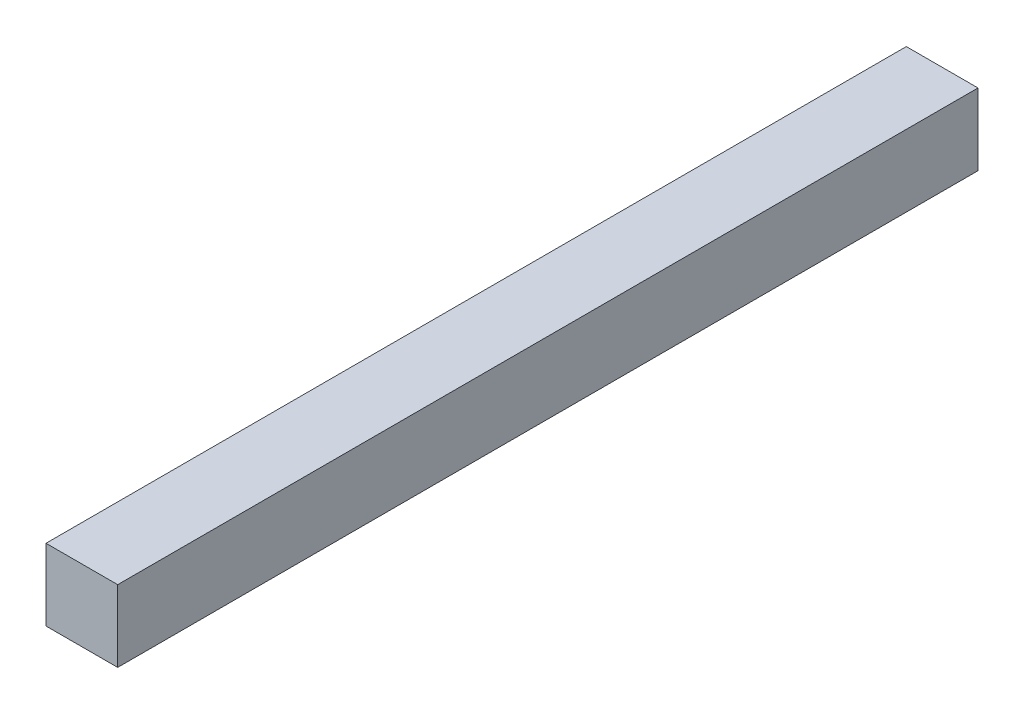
ISO-10303-21;
HEADER;
FILE_DESCRIPTION(('STEP AP214'),'2;1');
FILE_NAME('part.step','',(''),(''),'','','');
FILE_SCHEMA(('AUTOMOTIVE_DESIGN { 1 0 10303 214 1 1 1 1 }'));
ENDSEC;
DATA;
#1=APPLICATION_CONTEXT('core data for automotive mechanical design processes');
#2=APPLICATION_PROTOCOL_DEFINITION('international standard','automotive_design',2000,#1);
#3=PRODUCT_CONTEXT('',#1,'mechanical');
#4=PRODUCT('Part','Part','',(#3));
#5=PRODUCT_RELATED_PRODUCT_CATEGORY('part','',(#4));
#6=PRODUCT_DEFINITION_FORMATION('','',#4);
#7=PRODUCT_DEFINITION_CONTEXT('part definition',#1,'design');
#8=PRODUCT_DEFINITION('design','',#6,#7);
#9=PRODUCT_DEFINITION_SHAPE('','',#8);
#10=(LENGTH_UNIT() NAMED_UNIT(*) SI_UNIT(.MILLI.,.METRE.));
#11=(NAMED_UNIT(*) PLANE_ANGLE_UNIT() SI_UNIT($,.RADIAN.));
#12=(NAMED_UNIT(*) SI_UNIT($,.STERADIAN.) SOLID_ANGLE_UNIT());
#13=UNCERTAINTY_MEASURE_WITH_UNIT(LENGTH_MEASURE(1.E-05),#10,'distance_accuracy_value','');
#14=(GEOMETRIC_REPRESENTATION_CONTEXT(3) GLOBAL_UNCERTAINTY_ASSIGNED_CONTEXT((#13)) GLOBAL_UNIT_ASSIGNED_CONTEXT((#10,
#11,#12)) REPRESENTATION_CONTEXT('',''));
#15=CARTESIAN_POINT('',(0.,0.,0.));
#16=DIRECTION('',(0.,0.,1.));
#17=DIRECTION('',(1.,0.,0.));
#18=AXIS2_PLACEMENT_3D('',#15,#16,#17);
#19=CARTESIAN_POINT('',(0.,0.,300.));
#20=DIRECTION('',(1.,0.,0.));
#21=DIRECTION('',(0.,0.,-1.));
#22=AXIS2_PLACEMENT_3D('',#19,#20,#21);
#23=PLANE('',#22);
#24=DIRECTION('',(0.,-1.,0.));
#25=VECTOR('',#24,1.);
#26=CARTESIAN_POINT('',(0.,0.,0.));
#27=LINE('',#26,#25);
#28=CARTESIAN_POINT('',(0.,25.,0.));
#29=VERTEX_POINT('',#28);
#30=CARTESIAN_POINT('',(0.,0.,0.));
#31=VERTEX_POINT('',#30);
#32=EDGE_CURVE('E70',#29,#31,#27,.T.);
#33=ORIENTED_EDGE('',*,*,#32,.T.);
#34=DIRECTION('',(0.,0.,-1.));
#35=VECTOR('',#34,1.);
#36=CARTESIAN_POINT('',(0.,0.,300.));
#37=LINE('',#36,#35);
#38=CARTESIAN_POINT('',(0.,0.,300.));
#39=VERTEX_POINT('',#38);
#40=EDGE_CURVE('E11',#39,#31,#37,.T.);
#41=ORIENTED_EDGE('',*,*,#40,.F.);
#42=DIRECTION('',(0.,-1.,0.));
#43=VECTOR('',#42,1.);
#44=CARTESIAN_POINT('',(0.,0.,300.));
#45=LINE('',#44,#43);
#46=CARTESIAN_POINT('',(0.,25.,300.));
#47=VERTEX_POINT('',#46);
#48=EDGE_CURVE('E88',#47,#39,#45,.T.);
#49=ORIENTED_EDGE('',*,*,#48,.F.);
#50=DIRECTION('',(0.,0.,-1.));
#51=VECTOR('',#50,1.);
#52=CARTESIAN_POINT('',(0.,25.,300.));
#53=LINE('',#52,#51);
#54=EDGE_CURVE('E82',#47,#29,#53,.T.);
#55=ORIENTED_EDGE('',*,*,#54,.T.);
#56=EDGE_LOOP('',(#33,#41,#49,#55));
#57=FACE_BOUND('',#56,.T.);
#58=ADVANCED_FACE('F26',(#57),#23,.F.);
#59=CARTESIAN_POINT('',(0.,0.,300.));
#60=DIRECTION('',(0.,1.,0.));
#61=DIRECTION('',(0.,0.,1.));
#62=AXIS2_PLACEMENT_3D('',#59,#60,#61);
#63=PLANE('',#62);
#64=DIRECTION('',(1.,0.,0.));
#65=VECTOR('',#64,1.);
#66=CARTESIAN_POINT('',(0.,0.,0.));
#67=LINE('',#66,#65);
#68=CARTESIAN_POINT('',(25.,0.,0.));
#69=VERTEX_POINT('',#68);
#70=EDGE_CURVE('E66',#31,#69,#67,.T.);
#71=ORIENTED_EDGE('',*,*,#70,.T.);
#72=DIRECTION('',(0.,0.,-1.));
#73=VECTOR('',#72,1.);
#74=CARTESIAN_POINT('',(25.,0.,300.));
#75=LINE('',#74,#73);
#76=CARTESIAN_POINT('',(25.,0.,300.));
#77=VERTEX_POINT('',#76);
#78=EDGE_CURVE('E33',#77,#69,#75,.T.);
#79=ORIENTED_EDGE('',*,*,#78,.F.);
#80=DIRECTION('',(1.,0.,0.));
#81=VECTOR('',#80,1.);
#82=CARTESIAN_POINT('',(0.,0.,300.));
#83=LINE('',#82,#81);
#84=EDGE_CURVE('E78',#39,#77,#83,.T.);
#85=ORIENTED_EDGE('',*,*,#84,.F.);
#86=ORIENTED_EDGE('',*,*,#40,.T.);
#87=EDGE_LOOP('',(#71,#79,#85,#86));
#88=FACE_BOUND('',#87,.T.);
#89=ADVANCED_FACE('F77',(#88),#63,.F.);
#90=CARTESIAN_POINT('',(25.,0.,300.));
#91=DIRECTION('',(-1.,0.,0.));
#92=DIRECTION('',(0.,0.,1.));
#93=AXIS2_PLACEMENT_3D('',#90,#91,#92);
#94=PLANE('',#93);
#95=DIRECTION('',(0.,1.,0.));
#96=VECTOR('',#95,1.);
#97=CARTESIAN_POINT('',(25.,0.,0.));
#98=LINE('',#97,#96);
#99=CARTESIAN_POINT('',(25.,25.,0.));
#100=VERTEX_POINT('',#99);
#101=EDGE_CURVE('E71',#69,#100,#98,.T.);
#102=ORIENTED_EDGE('',*,*,#101,.T.);
#103=DIRECTION('',(0.,0.,-1.));
#104=VECTOR('',#103,1.);
#105=CARTESIAN_POINT('',(25.,25.,300.));
#106=LINE('',#105,#104);
#107=CARTESIAN_POINT('',(25.,25.,300.));
#108=VERTEX_POINT('',#107);
#109=EDGE_CURVE('E94',#108,#100,#106,.T.);
#110=ORIENTED_EDGE('',*,*,#109,.F.);
#111=DIRECTION('',(0.,1.,0.));
#112=VECTOR('',#111,1.);
#113=CARTESIAN_POINT('',(25.,0.,300.));
#114=LINE('',#113,#112);
#115=EDGE_CURVE('E45',#77,#108,#114,.T.);
#116=ORIENTED_EDGE('',*,*,#115,.F.);
#117=ORIENTED_EDGE('',*,*,#78,.T.);
#118=EDGE_LOOP('',(#102,#110,#116,#117));
#119=FACE_BOUND('',#118,.T.);
#120=ADVANCED_FACE('F97',(#119),#94,.F.);
#121=CARTESIAN_POINT('',(0.,25.,300.));
#122=DIRECTION('',(0.,-1.,0.));
#123=DIRECTION('',(0.,0.,-1.));
#124=AXIS2_PLACEMENT_3D('',#121,#122,#123);
#125=PLANE('',#124);
#126=DIRECTION('',(-1.,0.,0.));
#127=VECTOR('',#126,1.);
#128=CARTESIAN_POINT('',(0.,25.,0.));
#129=LINE('',#128,#127);
#130=EDGE_CURVE('E86',#100,#29,#129,.T.);
#131=ORIENTED_EDGE('',*,*,#130,.T.);
#132=ORIENTED_EDGE('',*,*,#54,.F.);
#133=DIRECTION('',(-1.,0.,0.));
#134=VECTOR('',#133,1.);
#135=CARTESIAN_POINT('',(0.,25.,300.));
#136=LINE('',#135,#134);
#137=EDGE_CURVE('E40',#108,#47,#136,.T.);
#138=ORIENTED_EDGE('',*,*,#137,.F.);
#139=ORIENTED_EDGE('',*,*,#109,.T.);
#140=EDGE_LOOP('',(#131,#132,#138,#139));
#141=FACE_BOUND('',#140,.T.);
#142=ADVANCED_FACE('F99',(#141),#125,.F.);
#143=CARTESIAN_POINT('',(0.,25.,300.));
#144=DIRECTION('',(0.,0.,-1.));
#145=DIRECTION('',(-1.,0.,0.));
#146=AXIS2_PLACEMENT_3D('',#143,#144,#145);
#147=PLANE('',#146);
#148=ORIENTED_EDGE('',*,*,#48,.T.);
#149=ORIENTED_EDGE('',*,*,#84,.T.);
#150=ORIENTED_EDGE('',*,*,#115,.T.);
#151=ORIENTED_EDGE('',*,*,#137,.T.);
#152=EDGE_LOOP('',(#148,#149,#150,#151));
#153=FACE_BOUND('',#152,.T.);
#154=ADVANCED_FACE('F100',(#153),#147,.F.);
#155=CARTESIAN_POINT('',(0.,25.,0.));
#156=DIRECTION('',(0.,0.,-1.));
#157=DIRECTION('',(-1.,0.,0.));
#158=AXIS2_PLACEMENT_3D('',#155,#156,#157);
#159=PLANE('',#158);
#160=ORIENTED_EDGE('',*,*,#32,.F.);
#161=ORIENTED_EDGE('',*,*,#130,.F.);
#162=ORIENTED_EDGE('',*,*,#101,.F.);
#163=ORIENTED_EDGE('',*,*,#70,.F.);
#164=EDGE_LOOP('',(#160,#161,#162,#163));
#165=FACE_BOUND('',#164,.T.);
#166=ADVANCED_FACE('F67',(#165),#159,.T.);
#167=CLOSED_SHELL('',(#58,#89,#120,#142,#154,#166));
#168=MANIFOLD_SOLID_BREP('B2',#167);
#169=ADVANCED_BREP_SHAPE_REPRESENTATION('',(#18,#168),#14);
#170=SHAPE_DEFINITION_REPRESENTATION(#9,#169);
ENDSEC;
END-ISO-10303-21;
